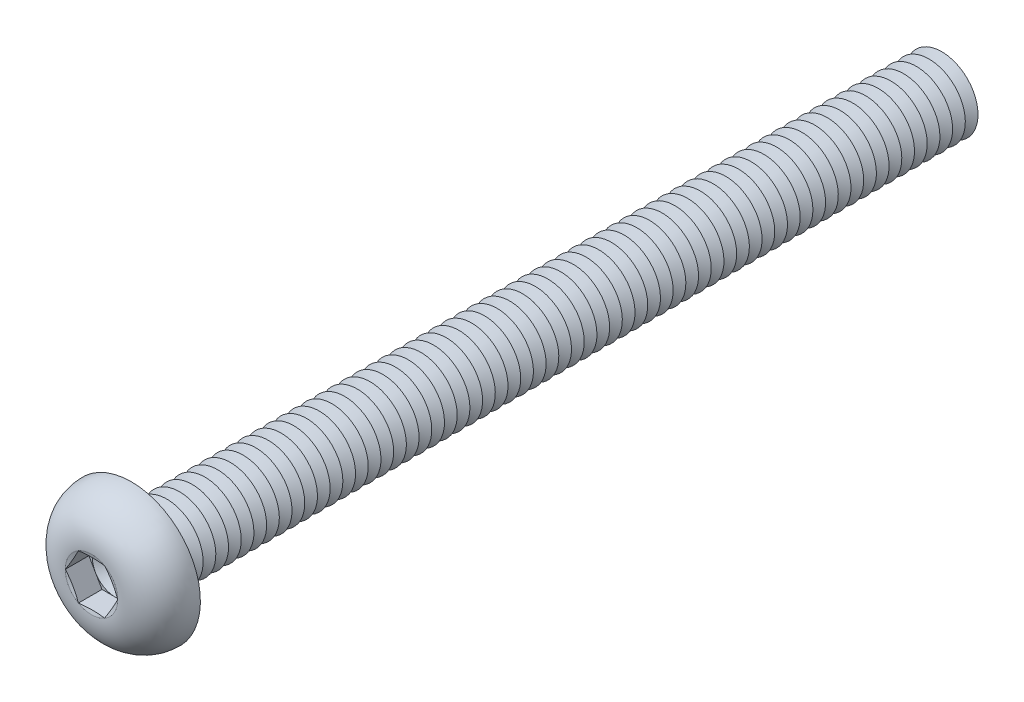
from build123d import *

# Parameters (mm, degrees)
FILLET1_R          = 0.35
LPATTERN1_COUNT    = 64
LPATTERN1_PITCH    = 0.7
CUT_EXTRUDE1_DEPTH = 1.3


with BuildPart() as part:
    # Sketch1 → Revolve1 (revolve)
    with BuildSketch(Plane(origin=(0, 0, 0), x_dir=(0, 0, -1), z_dir=(1, 0, 0))):
        with BuildLine():
            Line((0, 2), (0, 3.8))
            ThreePointArc((0, 3.8), (-1.611961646, 3.099623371), (-2.2, 1.443375))
            Line((-2.2, 1.443375), (-2.006624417, 0.7216875))
            Line((-2.006624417, 0.7216875), (-2.2, 0.7216875))
            Line((-2.2, 0.7216875), (-2.2, 0))
            Line((-2.2, 0), (45, 0))
            Line((45, 0), (45, 2))
            Line((45, 2), (0, 2))
        make_face()
    revolve(axis=Axis((0, 0, -45), (0, 0, 1)))

    # Fillet1
    fillet1_edges = [part.edges().sort_by_distance(p)[0] for p in [
        (0, -2, 0),
    ]]
    fillet(fillet1_edges, radius=FILLET1_R)

    # Sketch2 → Cut-Revolve1 (revolve, cut)
    with BuildSketch(Plane(origin=(0, 0, 0), x_dir=(0, 0, -1), z_dir=(1, 0, 0))):
        Polygon((44.65, 2), (45.35, 2), (45, 1.393782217), align=None)
    cut_revolve1 = revolve(axis=Axis((0, 0, -45), (0, 0, -1)), mode=Mode.SUBTRACT)

    # LPattern1: Cut-Revolve1 ×64
    with Locations(*[(0, 0, i * LPATTERN1_PITCH) for i in range(1, LPATTERN1_COUNT)]):
        add(cut_revolve1, mode=Mode.SUBTRACT)

    # Sketch3 → Cut-Extrude1 (cut)
    with BuildSketch(Plane.XY.offset(2.2)):
        Polygon((0.7216875, 1.249999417), (-0.7216875, 1.249999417), (-1.443375, 0), (-0.7216875, -1.249999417), (0.7216875, -1.249999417), (1.443375, 0), align=None)
    extrude(amount=-CUT_EXTRUDE1_DEPTH, mode=Mode.SUBTRACT)

    # Cut-Extrude2 cone 1 section (on through the dimple's axis) → Cut-Extrude2 (revolve, cut)
    with BuildSketch(Plane(origin=(0, 0, 0.9), x_dir=(0, -1, 0), z_dir=(1, 0, 0))):
        Polygon((0, 0), (1.249999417, 0), (0, 0.7216875), align=None)
    revolve(axis=Axis((0, 0, 0.9), (0, 0, -1)), mode=Mode.SUBTRACT)


solid = part.part
